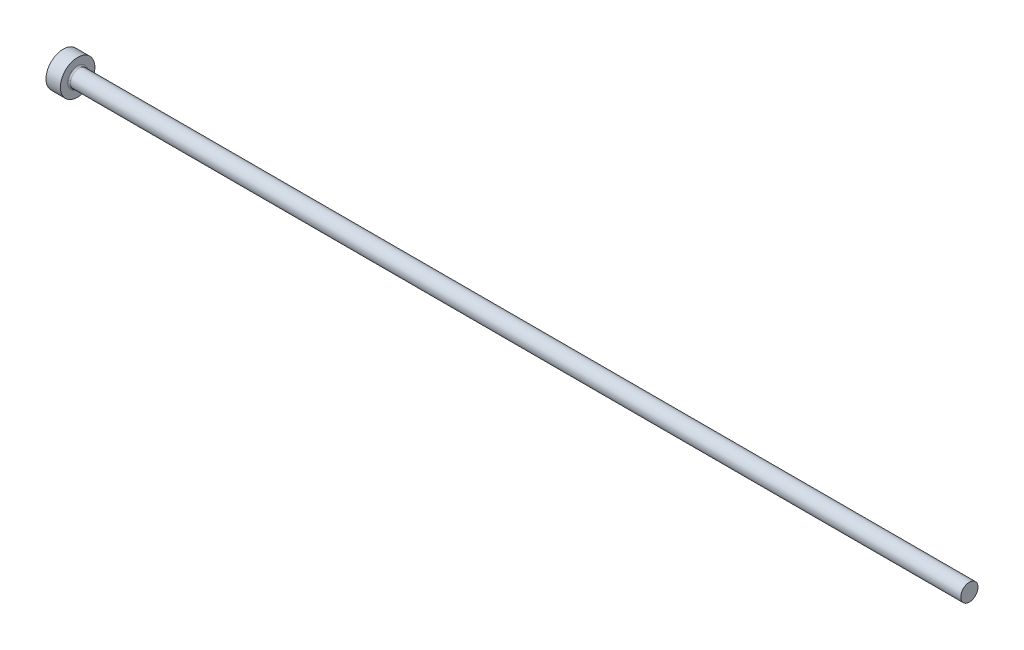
ISO-10303-21;
HEADER;
FILE_DESCRIPTION(('STEP AP214'),'2;1');
FILE_NAME('part.step','',(''),(''),'','','');
FILE_SCHEMA(('AUTOMOTIVE_DESIGN { 1 0 10303 214 1 1 1 1 }'));
ENDSEC;
DATA;
#1=APPLICATION_CONTEXT('core data for automotive mechanical design processes');
#2=APPLICATION_PROTOCOL_DEFINITION('international standard','automotive_design',2000,#1);
#3=PRODUCT_CONTEXT('',#1,'mechanical');
#4=PRODUCT('Part','Part','',(#3));
#5=PRODUCT_RELATED_PRODUCT_CATEGORY('part','',(#4));
#6=PRODUCT_DEFINITION_FORMATION('','',#4);
#7=PRODUCT_DEFINITION_CONTEXT('part definition',#1,'design');
#8=PRODUCT_DEFINITION('design','',#6,#7);
#9=PRODUCT_DEFINITION_SHAPE('','',#8);
#10=(LENGTH_UNIT() NAMED_UNIT(*) SI_UNIT(.MILLI.,.METRE.));
#11=(NAMED_UNIT(*) PLANE_ANGLE_UNIT() SI_UNIT($,.RADIAN.));
#12=(NAMED_UNIT(*) SI_UNIT($,.STERADIAN.) SOLID_ANGLE_UNIT());
#13=UNCERTAINTY_MEASURE_WITH_UNIT(LENGTH_MEASURE(1.E-05),#10,'distance_accuracy_value','');
#14=(GEOMETRIC_REPRESENTATION_CONTEXT(3) GLOBAL_UNCERTAINTY_ASSIGNED_CONTEXT((#13)) GLOBAL_UNIT_ASSIGNED_CONTEXT((#10,
#11,#12)) REPRESENTATION_CONTEXT('',''));
#15=CARTESIAN_POINT('',(0.,0.,0.));
#16=DIRECTION('',(0.,0.,1.));
#17=DIRECTION('',(1.,0.,0.));
#18=AXIS2_PLACEMENT_3D('',#15,#16,#17);
#19=CARTESIAN_POINT('',(0.,0.,0.));
#20=DIRECTION('',(-1.,0.,0.));
#21=DIRECTION('',(0.,-1.,0.));
#22=AXIS2_PLACEMENT_3D('',#19,#20,#21);
#23=PLANE('',#22);
#24=CARTESIAN_POINT('',(0.,0.,0.));
#25=DIRECTION('',(1.,0.,0.));
#26=DIRECTION('',(0.,1.,0.));
#27=AXIS2_PLACEMENT_3D('',#24,#25,#26);
#28=CIRCLE('',#27,6.);
#29=CARTESIAN_POINT('',(0.,6.,0.));
#30=VERTEX_POINT('',#29);
#31=EDGE_CURVE('E25',#30,#30,#28,.T.);
#32=ORIENTED_EDGE('',*,*,#31,.F.);
#33=EDGE_LOOP('',(#32));
#34=FACE_BOUND('',#33,.T.);
#35=ADVANCED_FACE('F14',(#34),#23,.T.);
#36=CARTESIAN_POINT('',(315.,0.,0.));
#37=DIRECTION('',(1.,0.,0.));
#38=DIRECTION('',(0.,1.,0.));
#39=AXIS2_PLACEMENT_3D('',#36,#37,#38);
#40=CYLINDRICAL_SURFACE('',#39,6.);
#41=ORIENTED_EDGE('',*,*,#31,.T.);
#42=EDGE_LOOP('',(#41));
#43=FACE_BOUND('',#42,.T.);
#44=CARTESIAN_POINT('',(5.,0.,0.));
#45=DIRECTION('',(1.,0.,0.));
#46=DIRECTION('',(0.,1.,0.));
#47=AXIS2_PLACEMENT_3D('',#44,#45,#46);
#48=CIRCLE('',#47,6.);
#49=CARTESIAN_POINT('',(5.,6.,0.));
#50=VERTEX_POINT('',#49);
#51=EDGE_CURVE('E29',#50,#50,#48,.T.);
#52=ORIENTED_EDGE('',*,*,#51,.F.);
#53=EDGE_LOOP('',(#52));
#54=FACE_BOUND('',#53,.T.);
#55=ADVANCED_FACE('F51',(#43,#54),#40,.T.);
#56=CARTESIAN_POINT('',(5.,6.,0.));
#57=DIRECTION('',(1.,0.,0.));
#58=DIRECTION('',(0.,1.,0.));
#59=AXIS2_PLACEMENT_3D('',#56,#57,#58);
#60=PLANE('',#59);
#61=CARTESIAN_POINT('',(5.,0.,0.));
#62=DIRECTION('',(1.,0.,0.));
#63=DIRECTION('',(0.,1.,0.));
#64=AXIS2_PLACEMENT_3D('',#61,#62,#63);
#65=CIRCLE('',#64,3.49999999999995);
#66=CARTESIAN_POINT('',(5.,3.49999999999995,0.));
#67=VERTEX_POINT('',#66);
#68=EDGE_CURVE('E9',#67,#67,#65,.F.);
#69=ORIENTED_EDGE('',*,*,#68,.T.);
#70=EDGE_LOOP('',(#69));
#71=FACE_BOUND('',#70,.T.);
#72=ORIENTED_EDGE('',*,*,#51,.T.);
#73=EDGE_LOOP('',(#72));
#74=FACE_BOUND('',#73,.T.);
#75=ADVANCED_FACE('F42',(#71,#74),#60,.T.);
#76=CARTESIAN_POINT('',(315.,0.,0.));
#77=DIRECTION('',(1.,0.,0.));
#78=DIRECTION('',(0.,1.,0.));
#79=AXIS2_PLACEMENT_3D('',#76,#77,#78);
#80=CYLINDRICAL_SURFACE('',#79,2.99999999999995);
#81=CARTESIAN_POINT('',(5.5,0.,0.));
#82=DIRECTION('',(1.,0.,0.));
#83=DIRECTION('',(0.,1.,0.));
#84=AXIS2_PLACEMENT_3D('',#81,#82,#83);
#85=CIRCLE('',#84,2.99999999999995);
#86=CARTESIAN_POINT('',(5.5,2.99999999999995,0.));
#87=VERTEX_POINT('',#86);
#88=EDGE_CURVE('E21',#87,#87,#85,.T.);
#89=ORIENTED_EDGE('',*,*,#88,.T.);
#90=EDGE_LOOP('',(#89));
#91=FACE_BOUND('',#90,.T.);
#92=CARTESIAN_POINT('',(315.,0.,0.));
#93=DIRECTION('',(1.,0.,0.));
#94=DIRECTION('',(0.,1.,0.));
#95=AXIS2_PLACEMENT_3D('',#92,#93,#94);
#96=CIRCLE('',#95,2.99999999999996);
#97=CARTESIAN_POINT('',(315.,2.99999999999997,0.));
#98=VERTEX_POINT('',#97);
#99=EDGE_CURVE('E34',#98,#98,#96,.T.);
#100=ORIENTED_EDGE('',*,*,#99,.F.);
#101=EDGE_LOOP('',(#100));
#102=FACE_BOUND('',#101,.T.);
#103=ADVANCED_FACE('F40',(#91,#102),#80,.T.);
#104=CARTESIAN_POINT('',(315.,3.,0.));
#105=DIRECTION('',(1.,0.,0.));
#106=DIRECTION('',(0.,1.,0.));
#107=AXIS2_PLACEMENT_3D('',#104,#105,#106);
#108=PLANE('',#107);
#109=ORIENTED_EDGE('',*,*,#99,.T.);
#110=EDGE_LOOP('',(#109));
#111=FACE_BOUND('',#110,.T.);
#112=ADVANCED_FACE('F38',(#111),#108,.T.);
#113=CARTESIAN_POINT('',(5.5,0.,0.));
#114=DIRECTION('',(1.,0.,0.));
#115=DIRECTION('',(0.,1.,0.));
#116=AXIS2_PLACEMENT_3D('',#113,#114,#115);
#117=TOROIDAL_SURFACE('',#116,3.49999999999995,0.5);
#118=ORIENTED_EDGE('',*,*,#68,.F.);
#119=EDGE_LOOP('',(#118));
#120=FACE_BOUND('',#119,.T.);
#121=ORIENTED_EDGE('',*,*,#88,.F.);
#122=EDGE_LOOP('',(#121));
#123=FACE_BOUND('',#122,.T.);
#124=ADVANCED_FACE('F16',(#120,#123),#117,.F.);
#125=CLOSED_SHELL('',(#35,#55,#75,#103,#112,#124));
#126=MANIFOLD_SOLID_BREP('B1',#125);
#127=ADVANCED_BREP_SHAPE_REPRESENTATION('',(#18,#126),#14);
#128=SHAPE_DEFINITION_REPRESENTATION(#9,#127);
ENDSEC;
END-ISO-10303-21;
